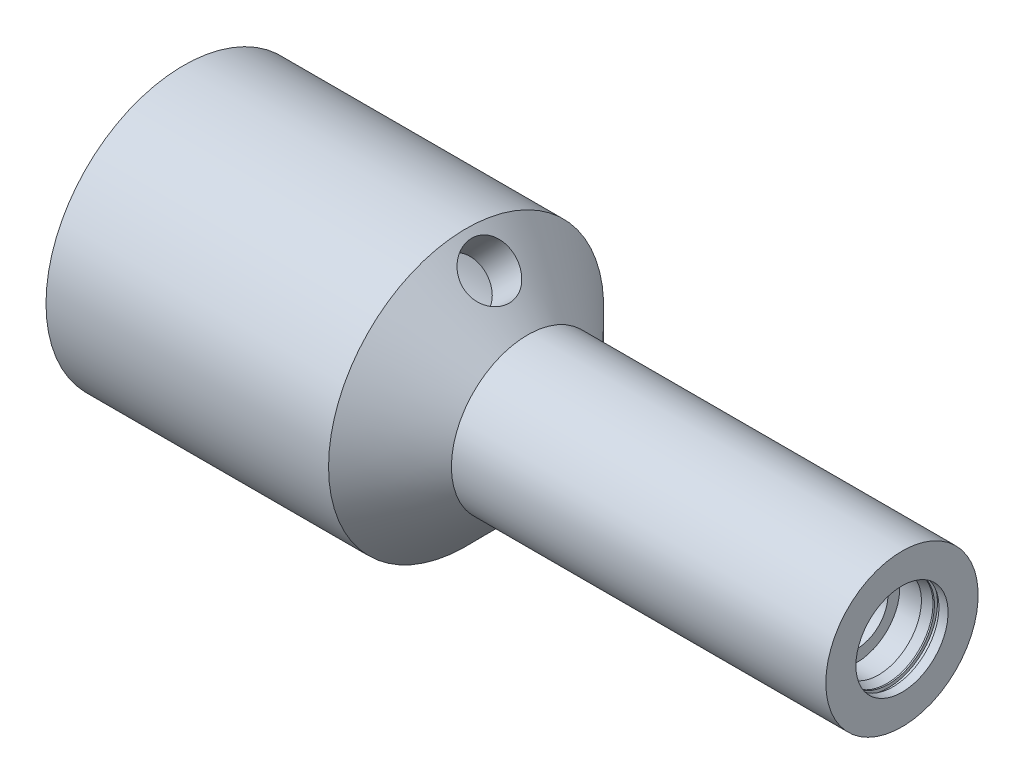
ISO-10303-21;
HEADER;
FILE_DESCRIPTION(('STEP AP214'),'2;1');
FILE_NAME('part.step','',(''),(''),'','','');
FILE_SCHEMA(('AUTOMOTIVE_DESIGN { 1 0 10303 214 1 1 1 1 }'));
ENDSEC;
DATA;
#1=APPLICATION_CONTEXT('core data for automotive mechanical design processes');
#2=APPLICATION_PROTOCOL_DEFINITION('international standard','automotive_design',2000,#1);
#3=PRODUCT_CONTEXT('',#1,'mechanical');
#4=PRODUCT('Part','Part','',(#3));
#5=PRODUCT_RELATED_PRODUCT_CATEGORY('part','',(#4));
#6=PRODUCT_DEFINITION_FORMATION('','',#4);
#7=PRODUCT_DEFINITION_CONTEXT('part definition',#1,'design');
#8=PRODUCT_DEFINITION('design','',#6,#7);
#9=PRODUCT_DEFINITION_SHAPE('','',#8);
#10=(LENGTH_UNIT() NAMED_UNIT(*) SI_UNIT(.MILLI.,.METRE.));
#11=(NAMED_UNIT(*) PLANE_ANGLE_UNIT() SI_UNIT($,.RADIAN.));
#12=(NAMED_UNIT(*) SI_UNIT($,.STERADIAN.) SOLID_ANGLE_UNIT());
#13=UNCERTAINTY_MEASURE_WITH_UNIT(LENGTH_MEASURE(1.E-05),#10,'distance_accuracy_value','');
#14=(GEOMETRIC_REPRESENTATION_CONTEXT(3) GLOBAL_UNCERTAINTY_ASSIGNED_CONTEXT((#13)) GLOBAL_UNIT_ASSIGNED_CONTEXT((#10,
#11,#12)) REPRESENTATION_CONTEXT('',''));
#15=CARTESIAN_POINT('',(0.,0.,0.));
#16=DIRECTION('',(0.,0.,1.));
#17=DIRECTION('',(1.,0.,0.));
#18=AXIS2_PLACEMENT_3D('',#15,#16,#17);
#19=CARTESIAN_POINT('',(64.0540902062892,0.,1.04083408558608E-13));
#20=DIRECTION('',(-1.,0.,0.));
#21=DIRECTION('',(0.,0.,1.));
#22=AXIS2_PLACEMENT_3D('',#19,#20,#21);
#23=CONICAL_SURFACE('',#22,30.1625,0.785398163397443);
#24=CARTESIAN_POINT('',(64.0540902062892,0.,1.04083408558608E-13));
#25=DIRECTION('',(-1.,0.,0.));
#26=DIRECTION('',(0.,0.,1.));
#27=AXIS2_PLACEMENT_3D('',#24,#25,#26);
#28=CIRCLE('',#27,30.1625);
#29=CARTESIAN_POINT('',(64.0540902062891,0.,30.1625000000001));
#30=VERTEX_POINT('',#29);
#31=EDGE_CURVE('E159',#30,#30,#28,.T.);
#32=ORIENTED_EDGE('',*,*,#31,.T.);
#33=EDGE_LOOP('',(#32));
#34=FACE_BOUND('',#33,.T.);
#35=CARTESIAN_POINT('',(77.7065902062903,0.,-1.2490009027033E-13));
#36=DIRECTION('',(-1.,0.,0.));
#37=DIRECTION('',(0.,0.,1.));
#38=AXIS2_PLACEMENT_3D('',#35,#36,#37);
#39=CIRCLE('',#38,16.51);
#40=CARTESIAN_POINT('',(77.7065902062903,0.,16.5099999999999));
#41=VERTEX_POINT('',#40);
#42=EDGE_CURVE('E156',#41,#41,#39,.T.);
#43=ORIENTED_EDGE('',*,*,#42,.F.);
#44=EDGE_LOOP('',(#43));
#45=FACE_BOUND('',#44,.T.);
#46=CARTESIAN_POINT('',(71.1083064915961,22.1790884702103,-6.48696941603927));
#47=CARTESIAN_POINT('',(71.229726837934,22.046299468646,-6.5084440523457));
#48=CARTESIAN_POINT('',(71.3527248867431,21.9138201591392,-6.5224798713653));
#49=CARTESIAN_POINT('',(71.6012549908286,21.6504371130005,-6.53558926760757));
#50=CARTESIAN_POINT('',(71.7267873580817,21.5195335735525,-6.53466099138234));
#51=CARTESIAN_POINT('',(71.9796076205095,21.260345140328,-6.51782200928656));
#52=CARTESIAN_POINT('',(72.1068960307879,21.132061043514,-6.5019068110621));
#53=CARTESIAN_POINT('',(72.362403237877,20.8790846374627,-6.45519486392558));
#54=CARTESIAN_POINT('',(72.4906223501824,20.7543936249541,-6.42439281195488));
#55=CARTESIAN_POINT('',(72.7469658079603,20.5096469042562,-6.34816172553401));
#56=CARTESIAN_POINT('',(72.8750901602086,20.3895881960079,-6.30274234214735));
#57=CARTESIAN_POINT('',(73.1304385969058,20.1547963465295,-6.19759793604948));
#58=CARTESIAN_POINT('',(73.2576623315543,20.0400651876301,-6.13786763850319));
#59=CARTESIAN_POINT('',(73.5101303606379,19.8167431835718,-6.00459341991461));
#60=CARTESIAN_POINT('',(73.6353755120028,19.7081496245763,-5.93105566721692));
#61=CARTESIAN_POINT('',(73.8829918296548,19.4976105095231,-5.77066646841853));
#62=CARTESIAN_POINT('',(74.005361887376,19.3956674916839,-5.68380998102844));
#63=CARTESIAN_POINT('',(74.2465684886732,19.1986287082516,-5.49711821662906));
#64=CARTESIAN_POINT('',(74.3653917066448,19.1035572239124,-5.39724010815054));
#65=CARTESIAN_POINT('',(74.5980874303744,18.9209773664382,-5.18539132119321));
#66=CARTESIAN_POINT('',(74.7119576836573,18.8334724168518,-5.0734152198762));
#67=CARTESIAN_POINT('',(74.9336461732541,18.6663469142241,-4.83817624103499));
#68=CARTESIAN_POINT('',(75.0414647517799,18.5867259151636,-4.71491400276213));
#69=CARTESIAN_POINT('',(75.2500248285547,18.4355363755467,-4.45790859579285));
#70=CARTESIAN_POINT('',(75.3507662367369,18.3639679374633,-4.324165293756));
#71=CARTESIAN_POINT('',(75.5461160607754,18.227608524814,-4.04424040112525));
#72=CARTESIAN_POINT('',(75.6405583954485,18.1629846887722,-3.89786138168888));
#73=CARTESIAN_POINT('',(75.8199182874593,18.0422806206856,-3.5961085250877));
#74=CARTESIAN_POINT('',(75.9048393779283,17.9861972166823,-3.4407380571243));
#75=CARTESIAN_POINT('',(76.0642079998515,17.8825154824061,-3.1219174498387));
#76=CARTESIAN_POINT('',(76.1386515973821,17.8349203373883,-2.95846430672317));
#77=CARTESIAN_POINT('',(76.2760392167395,17.7482202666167,-2.62469767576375));
#78=CARTESIAN_POINT('',(76.3389878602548,17.7091119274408,-2.45438697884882));
#79=CARTESIAN_POINT('',(76.4523830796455,17.6394140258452,-2.10853924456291));
#80=CARTESIAN_POINT('',(76.5028664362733,17.6087993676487,-1.93301933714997));
#81=CARTESIAN_POINT('',(76.590818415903,17.5558926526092,-1.57759052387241));
#82=CARTESIAN_POINT('',(76.6282921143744,17.5335973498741,-1.39768335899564));
#83=CARTESIAN_POINT('',(76.6896723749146,17.4972695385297,-1.0347545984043));
#84=CARTESIAN_POINT('',(76.7135796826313,17.4832365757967,-0.851733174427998));
#85=CARTESIAN_POINT('',(76.7474459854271,17.46340163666,-0.483963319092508));
#86=CARTESIAN_POINT('',(76.7574053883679,17.4575994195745,-0.299214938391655));
#87=CARTESIAN_POINT('',(76.7631172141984,17.4542690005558,0.0643599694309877));
#88=CARTESIAN_POINT('',(76.7593357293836,17.456469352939,0.243176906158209));
#89=CARTESIAN_POINT('',(76.738651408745,17.4685507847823,0.599851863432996));
#90=CARTESIAN_POINT('',(76.7217440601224,17.4784345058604,0.777709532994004));
#91=CARTESIAN_POINT('',(76.6750670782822,17.5059015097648,1.13106113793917));
#92=CARTESIAN_POINT('',(76.6453019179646,17.5234821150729,1.30655587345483));
#93=CARTESIAN_POINT('',(76.5733345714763,17.5663844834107,1.6540801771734));
#94=CARTESIAN_POINT('',(76.531127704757,17.5917091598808,1.82610841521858));
#95=CARTESIAN_POINT('',(76.4351252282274,17.64998963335,2.16458220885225));
#96=CARTESIAN_POINT('',(76.381390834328,17.6829051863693,2.33105208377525));
#97=CARTESIAN_POINT('',(76.262892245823,17.756498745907,2.6583187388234));
#98=CARTESIAN_POINT('',(76.1981240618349,17.7971795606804,2.8191134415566));
#99=CARTESIAN_POINT('',(76.058386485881,17.8863289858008,3.13392446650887));
#100=CARTESIAN_POINT('',(75.9834192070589,17.9347959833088,3.28794218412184));
#101=CARTESIAN_POINT('',(75.8241101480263,18.0395693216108,3.58834724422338));
#102=CARTESIAN_POINT('',(75.7397648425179,18.0958786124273,3.73473168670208));
#103=CARTESIAN_POINT('',(75.559749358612,18.2182820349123,4.02354905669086));
#104=CARTESIAN_POINT('',(75.4638000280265,18.284634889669,4.16569851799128));
#105=CARTESIAN_POINT('',(75.2639007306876,18.4256562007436,4.43998123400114));
#106=CARTESIAN_POINT('',(75.1599477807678,18.5003277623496,4.57211071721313));
#107=CARTESIAN_POINT('',(74.9451614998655,18.6578220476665,4.82538572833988));
#108=CARTESIAN_POINT('',(74.8343303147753,18.7406422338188,4.9465346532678));
#109=CARTESIAN_POINT('',(74.6067836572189,18.9142773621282,5.17711466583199));
#110=CARTESIAN_POINT('',(74.4900660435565,19.0050952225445,5.28654144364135));
#111=CARTESIAN_POINT('',(74.2503592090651,19.1955782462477,5.49415239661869));
#112=CARTESIAN_POINT('',(74.127309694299,19.2953400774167,5.59217837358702));
#113=CARTESIAN_POINT('',(73.8774221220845,19.5022734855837,5.77464342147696));
#114=CARTESIAN_POINT('',(73.7505840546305,19.609445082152,5.85908245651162));
#115=CARTESIAN_POINT('',(73.494228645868,19.8306153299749,6.01371289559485));
#116=CARTESIAN_POINT('',(73.3647115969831,19.9446132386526,6.08390584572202));
#117=CARTESIAN_POINT('',(73.104060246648,20.1787434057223,6.20950044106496));
#118=CARTESIAN_POINT('',(72.9729259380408,20.2988756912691,6.26490202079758));
#119=CARTESIAN_POINT('',(72.7125121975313,20.5421815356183,6.35957872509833));
#120=CARTESIAN_POINT('',(72.583243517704,20.6652572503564,6.39913410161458));
#121=CARTESIAN_POINT('',(72.3250787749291,20.9156467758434,6.46327992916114));
#122=CARTESIAN_POINT('',(72.1961828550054,21.0429620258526,6.48786524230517));
#123=CARTESIAN_POINT('',(71.8115120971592,21.4297462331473,6.53878459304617));
#124=CARTESIAN_POINT('',(71.55746268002,21.6943264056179,6.54238777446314));
#125=CARTESIAN_POINT('',(71.0634010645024,22.2255057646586,6.4889861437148));
#126=CARTESIAN_POINT('',(70.8232810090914,22.4920638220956,6.4325400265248));
#127=CARTESIAN_POINT('',(70.3596163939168,23.0210646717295,6.2617255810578));
#128=CARTESIAN_POINT('',(70.1360729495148,23.2835071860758,6.14735335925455));
#129=CARTESIAN_POINT('',(69.7073197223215,23.7987440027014,5.86218864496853));
#130=CARTESIAN_POINT('',(69.5023718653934,24.0513781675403,5.69071364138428));
#131=CARTESIAN_POINT('',(69.1176857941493,24.5349258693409,5.29647246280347));
#132=CARTESIAN_POINT('',(68.9379496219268,24.7658376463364,5.07370213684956));
#133=CARTESIAN_POINT('',(68.6047587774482,25.2006491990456,4.57981258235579));
#134=CARTESIAN_POINT('',(68.4516624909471,25.4041733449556,4.30812132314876));
#135=CARTESIAN_POINT('',(68.1772361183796,25.7734009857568,3.72552659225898));
#136=CARTESIAN_POINT('',(68.0559055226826,25.9391050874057,3.41462374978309));
#137=CARTESIAN_POINT('',(67.8997477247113,26.1541737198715,2.9265002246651));
#138=CARTESIAN_POINT('',(67.8520514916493,26.2202111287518,2.76041806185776));
#139=CARTESIAN_POINT('',(67.7653293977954,26.340724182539,2.42193261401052));
#140=CARTESIAN_POINT('',(67.7263003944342,26.3952040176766,2.2495316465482));
#141=CARTESIAN_POINT('',(67.6571022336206,26.492067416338,1.89961805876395));
#142=CARTESIAN_POINT('',(67.6269341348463,26.5344495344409,1.72210483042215));
#143=CARTESIAN_POINT('',(67.5756104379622,26.6066932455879,1.36326969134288));
#144=CARTESIAN_POINT('',(67.554454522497,26.6365552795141,1.18194791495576));
#145=CARTESIAN_POINT('',(67.5215044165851,26.6831164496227,0.819475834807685));
#146=CARTESIAN_POINT('',(67.5095790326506,26.7000000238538,0.638361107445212));
#147=CARTESIAN_POINT('',(67.4946465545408,26.7211467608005,0.275033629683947));
#148=CARTESIAN_POINT('',(67.4916392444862,26.7254102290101,0.0928209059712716));
#149=CARTESIAN_POINT('',(67.4945579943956,26.7212745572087,-0.271414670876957));
#150=CARTESIAN_POINT('',(67.5004853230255,26.7128736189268,-0.453437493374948));
#151=CARTESIAN_POINT('',(67.5212417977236,26.6834948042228,-0.815885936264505));
#152=CARTESIAN_POINT('',(67.5360676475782,26.6625215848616,-0.996312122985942));
#153=CARTESIAN_POINT('',(67.5744036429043,26.6084074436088,-1.35303464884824));
#154=CARTESIAN_POINT('',(67.5978497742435,26.5753562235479,-1.52935149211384));
#155=CARTESIAN_POINT('',(67.6533139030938,26.4974007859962,-1.87790069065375));
#156=CARTESIAN_POINT('',(67.6853287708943,26.4525008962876,-2.05013451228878));
#157=CARTESIAN_POINT('',(67.7577942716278,26.3512513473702,-2.38945207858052));
#158=CARTESIAN_POINT('',(67.7982479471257,26.2948975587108,-2.55653394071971));
#159=CARTESIAN_POINT('',(67.88737916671,26.171300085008,-2.88428252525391));
#160=CARTESIAN_POINT('',(67.9360538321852,26.104060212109,-3.04495146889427));
#161=CARTESIAN_POINT('',(68.041836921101,25.958715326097,-3.36011045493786));
#162=CARTESIAN_POINT('',(68.0990096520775,25.8805277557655,-3.51454083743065));
#163=CARTESIAN_POINT('',(68.2212164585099,25.7144474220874,-3.81475261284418));
#164=CARTESIAN_POINT('',(68.2862477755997,25.6265580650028,-3.96053701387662));
#165=CARTESIAN_POINT('',(68.423940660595,25.4417885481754,-4.24262537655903));
#166=CARTESIAN_POINT('',(68.4966065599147,25.3449032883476,-4.37892388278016));
#167=CARTESIAN_POINT('',(68.6491955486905,25.1430768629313,-4.64100037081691));
#168=CARTESIAN_POINT('',(68.7291160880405,25.0381385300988,-4.76678201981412));
#169=CARTESIAN_POINT('',(68.8971579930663,24.819442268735,-5.00886999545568));
#170=CARTESIAN_POINT('',(68.9853852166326,24.7055748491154,-5.12500399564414));
#171=CARTESIAN_POINT('',(69.1685639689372,24.4714962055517,-5.34479902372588));
#172=CARTESIAN_POINT('',(69.2635131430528,24.3512872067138,-5.44846438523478));
#173=CARTESIAN_POINT('',(69.4597053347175,24.1055820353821,-5.64261936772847));
#174=CARTESIAN_POINT('',(69.5609458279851,23.9800879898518,-5.73311422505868));
#175=CARTESIAN_POINT('',(69.7692519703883,23.7249020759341,-5.90032139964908));
#176=CARTESIAN_POINT('',(69.8763167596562,23.595210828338,-5.97703574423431));
#177=CARTESIAN_POINT('',(70.1610591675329,23.254659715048,-6.15750456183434));
#178=CARTESIAN_POINT('',(70.3429075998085,23.041341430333,-6.25025680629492));
#179=CARTESIAN_POINT('',(70.717884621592,22.6114389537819,-6.39754166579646));
#180=CARTESIAN_POINT('',(70.9110127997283,22.3948548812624,-6.45207567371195));
#181=CARTESIAN_POINT('',(71.1083064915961,22.1790884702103,-6.48696941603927));
#182=B_SPLINE_CURVE_WITH_KNOTS('',3,(#46,#47,#48,#49,#50,#51,#52,#53,#54,#55,#56,#57,#58,#59,
#60,#61,#62,#63,#64,#65,#66,#67,#68,#69,#70,#71,#72,#73,#74,#75,#76,#77,#78,#79,#80,#81,#82,#83,
#84,#85,#86,#87,#88,#89,#90,#91,#92,#93,#94,#95,#96,#97,#98,#99,#100,#101,#102,#103,#104,#105,
#106,#107,#108,#109,#110,#111,#112,#113,#114,#115,#116,#117,#118,#119,#120,#121,#122,#123,#124,
#125,#126,#127,#128,#129,#130,#131,#132,#133,#134,#135,#136,#137,#138,#139,#140,#141,#142,#143,
#144,#145,#146,#147,#148,#149,#150,#151,#152,#153,#154,#155,#156,#157,#158,#159,#160,#161,#162,
#163,#164,#165,#166,#167,#168,#169,#170,#171,#172,#173,#174,#175,#176,#177,#178,#179,#180,#181),
.UNSPECIFIED.,.T.,.F.,(4,2,2,2,2,2,2,2,2,2,2,2,2,2,2,2,2,2,2,2,2,2,2,2,2,2,2,2,2,2,2,2,2,2,2,2,
2,2,2,2,2,2,2,2,2,2,2,2,2,2,2,2,2,2,2,2,2,2,2,2,2,2,2,2,2,2,2,4),(0.,0.543380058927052,
1.08682742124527,1.630437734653,2.17424183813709,2.71768763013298,3.26133403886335,
3.8047381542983,4.34834846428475,4.89379422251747,5.4394854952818,5.98514587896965,
6.53081320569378,7.0875611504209,7.64410180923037,8.20085087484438,8.75737559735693,
9.31223803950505,9.86688376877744,10.4214990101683,10.9760980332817,11.5120632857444,
12.0482128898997,12.5841761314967,13.1203412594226,13.6537266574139,14.1873053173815,
14.7207735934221,15.2544430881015,15.8054736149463,16.356710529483,16.9077763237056,
17.4590440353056,18.0172249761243,18.5754073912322,19.1335291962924,19.6916534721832,
20.2394177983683,20.7873700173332,21.8820513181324,22.9666361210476,24.0512938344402,
25.1494111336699,26.2476173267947,27.3596147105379,28.4715942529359,29.0259949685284,
29.5801943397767,30.1344598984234,30.6887059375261,31.2349219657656,31.7811247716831,
32.3274051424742,32.8734832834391,33.4155855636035,33.9574901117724,34.4995903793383,
35.0415012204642,35.5877439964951,36.1337955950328,36.6801586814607,37.2263304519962,
37.7807728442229,38.3350219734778,38.8890501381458,39.4429967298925,40.3259571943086,
41.2088854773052),.UNSPECIFIED.);
#183=CARTESIAN_POINT('',(71.1083064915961,22.1790884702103,-6.48696941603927));
#184=VERTEX_POINT('',#183);
#185=EDGE_CURVE('E81',#184,#184,#182,.T.);
#186=ORIENTED_EDGE('',*,*,#185,.F.);
#187=EDGE_LOOP('',(#186));
#188=FACE_BOUND('',#187,.T.);
#189=ADVANCED_FACE('F32',(#34,#45,#188),#23,.F.);
#190=CARTESIAN_POINT('',(88.9000000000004,0.,-1.31838984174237E-13));
#191=DIRECTION('',(-1.,0.,0.));
#192=DIRECTION('',(0.,0.,1.));
#193=AXIS2_PLACEMENT_3D('',#190,#191,#192);
#194=CONICAL_SURFACE('',#193,19.685,0.785398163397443);
#195=CARTESIAN_POINT('',(73.025,0.,-1.17961196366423E-13));
#196=DIRECTION('',(-1.,0.,0.));
#197=DIRECTION('',(0.,0.,1.));
#198=AXIS2_PLACEMENT_3D('',#195,#196,#197);
#199=CIRCLE('',#198,35.56);
#200=CARTESIAN_POINT('',(73.0249999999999,0.,35.5599999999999));
#201=VERTEX_POINT('',#200);
#202=EDGE_CURVE('E114',#201,#201,#199,.T.);
#203=ORIENTED_EDGE('',*,*,#202,.F.);
#204=EDGE_LOOP('',(#203));
#205=FACE_BOUND('',#204,.T.);
#206=CARTESIAN_POINT('',(88.9000000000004,0.,-1.31838984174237E-13));
#207=DIRECTION('',(-1.,0.,0.));
#208=DIRECTION('',(0.,0.,1.));
#209=AXIS2_PLACEMENT_3D('',#206,#207,#208);
#210=CIRCLE('',#209,19.685);
#211=CARTESIAN_POINT('',(88.9000000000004,0.,19.6849999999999));
#212=VERTEX_POINT('',#211);
#213=EDGE_CURVE('E117',#212,#212,#210,.T.);
#214=ORIENTED_EDGE('',*,*,#213,.T.);
#215=EDGE_LOOP('',(#214));
#216=FACE_BOUND('',#215,.T.);
#217=CARTESIAN_POINT('',(82.6678779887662,25.4992847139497,-4.63504502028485));
#218=CARTESIAN_POINT('',(82.563693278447,25.5795238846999,-4.77617189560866));
#219=CARTESIAN_POINT('',(82.4554008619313,25.6640297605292,-4.91178814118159));
#220=CARTESIAN_POINT('',(82.2315616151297,25.841339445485,-5.17117623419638));
#221=CARTESIAN_POINT('',(82.1160133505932,25.9341448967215,-5.29494572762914));
#222=CARTESIAN_POINT('',(81.8786790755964,26.1277234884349,-5.52980349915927));
#223=CARTESIAN_POINT('',(81.7568892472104,26.2285015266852,-5.64088387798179));
#224=CARTESIAN_POINT('',(81.5081638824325,26.4375567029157,-5.84952985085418));
#225=CARTESIAN_POINT('',(81.3812265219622,26.5458365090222,-5.94709059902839));
#226=CARTESIAN_POINT('',(81.1233364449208,26.7692995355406,-6.12793629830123));
#227=CARTESIAN_POINT('',(80.9923839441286,26.8844823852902,-6.21122201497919));
#228=CARTESIAN_POINT('',(80.7275343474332,27.1210988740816,-6.36290834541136));
#229=CARTESIAN_POINT('',(80.5936372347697,27.2425325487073,-6.4313088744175));
#230=CARTESIAN_POINT('',(80.3239991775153,27.4908583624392,-6.5526939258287));
#231=CARTESIAN_POINT('',(80.1882587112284,27.6177491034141,-6.60568237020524));
#232=CARTESIAN_POINT('',(79.9159396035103,27.8761655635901,-6.69586479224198));
#233=CARTESIAN_POINT('',(79.7793609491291,28.0076913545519,-6.73305852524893));
#234=CARTESIAN_POINT('',(79.5076031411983,28.2732364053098,-6.79110565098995));
#235=CARTESIAN_POINT('',(79.3724224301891,28.4072226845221,-6.81210272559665));
#236=CARTESIAN_POINT('',(79.1031251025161,28.6778820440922,-6.83815619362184));
#237=CARTESIAN_POINT('',(78.9690088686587,28.8145560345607,-6.84320709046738));
#238=CARTESIAN_POINT('',(78.7028266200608,29.0894570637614,-6.83732094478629));
#239=CARTESIAN_POINT('',(78.5707599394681,29.2276835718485,-6.82638920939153));
#240=CARTESIAN_POINT('',(78.3094226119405,29.5047043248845,-6.78862823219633));
#241=CARTESIAN_POINT('',(78.1801530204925,29.6434987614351,-6.76179309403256));
#242=CARTESIAN_POINT('',(77.9255726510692,29.9201413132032,-6.69251403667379));
#243=CARTESIAN_POINT('',(77.8002525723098,30.0579909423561,-6.65011031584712));
#244=CARTESIAN_POINT('',(77.5539023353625,30.3320440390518,-6.54997981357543));
#245=CARTESIAN_POINT('',(77.4328737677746,30.4682468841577,-6.49224741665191));
#246=CARTESIAN_POINT('',(77.1958611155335,30.7378036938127,-6.36190425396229));
#247=CARTESIAN_POINT('',(77.0798753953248,30.8711585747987,-6.28929835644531));
#248=CARTESIAN_POINT('',(76.8534780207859,31.1340222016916,-6.12968018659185));
#249=CARTESIAN_POINT('',(76.7430684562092,31.2635294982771,-6.04266256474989));
#250=CARTESIAN_POINT('',(76.5274948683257,31.5186886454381,-5.8540215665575));
#251=CARTESIAN_POINT('',(76.4223850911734,31.6442969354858,-5.75227724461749));
#252=CARTESIAN_POINT('',(76.2189532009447,31.8894400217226,-5.5354351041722));
#253=CARTESIAN_POINT('',(76.1206336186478,32.0089725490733,-5.42033234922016));
#254=CARTESIAN_POINT('',(75.9313370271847,32.240860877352,-5.17762272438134));
#255=CARTESIAN_POINT('',(75.8403575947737,32.3532190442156,-5.05002001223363));
#256=CARTESIAN_POINT('',(75.6661399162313,32.5698434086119,-4.7831646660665));
#257=CARTESIAN_POINT('',(75.5829045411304,32.6741066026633,-4.64390774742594));
#258=CARTESIAN_POINT('',(75.3446669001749,32.9743323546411,-4.20857583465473));
#259=CARTESIAN_POINT('',(75.2019570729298,33.1567145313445,-3.8960008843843));
#260=CARTESIAN_POINT('',(74.9525067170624,33.4781947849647,-3.23638679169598));
#261=CARTESIAN_POINT('',(74.8457649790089,33.6172943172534,-2.88934880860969));
#262=CARTESIAN_POINT('',(74.670814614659,33.8464848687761,-2.17264655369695));
#263=CARTESIAN_POINT('',(74.6023773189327,33.9368666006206,-1.80313147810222));
#264=CARTESIAN_POINT('',(74.5044903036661,34.0664293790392,-1.05023932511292));
#265=CARTESIAN_POINT('',(74.4750380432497,34.105613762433,-0.666863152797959));
#266=CARTESIAN_POINT('',(74.4558171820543,34.1311670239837,0.098847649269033));
#267=CARTESIAN_POINT('',(74.4656612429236,34.1180514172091,0.481155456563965));
#268=CARTESIAN_POINT('',(74.523958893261,34.04066226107,1.23754989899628));
#269=CARTESIAN_POINT('',(74.5724118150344,33.9763895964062,1.61163667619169));
#270=CARTESIAN_POINT('',(74.7068133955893,33.7992640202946,2.34033480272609));
#271=CARTESIAN_POINT('',(74.7926932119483,33.6865003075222,2.69498056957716));
#272=CARTESIAN_POINT('',(75.0002333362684,33.4165284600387,3.37573250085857));
#273=CARTESIAN_POINT('',(75.1218953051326,33.2593182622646,3.70183733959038));
#274=CARTESIAN_POINT('',(75.3997997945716,32.9045670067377,4.31918757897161));
#275=CARTESIAN_POINT('',(75.556319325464,32.7067039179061,4.6101231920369));
#276=CARTESIAN_POINT('',(75.9003361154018,32.2783746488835,5.14606545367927));
#277=CARTESIAN_POINT('',(76.0878352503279,32.0479064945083,5.39106931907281));
#278=CARTESIAN_POINT('',(76.4919255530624,31.5600980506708,5.83037284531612));
#279=CARTESIAN_POINT('',(76.708755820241,31.3025412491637,6.02421242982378));
#280=CARTESIAN_POINT('',(77.1657705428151,30.7710011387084,6.35287601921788));
#281=CARTESIAN_POINT('',(77.4059548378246,30.497017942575,6.48770042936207));
#282=CARTESIAN_POINT('',(77.9039932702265,29.9422286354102,6.69423769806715));
#283=CARTESIAN_POINT('',(78.161819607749,29.6614336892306,6.7660474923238));
#284=CARTESIAN_POINT('',(78.6892620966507,29.1018160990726,6.84469748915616));
#285=CARTESIAN_POINT('',(78.9588773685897,28.8229933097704,6.85154252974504));
#286=CARTESIAN_POINT('',(79.5000944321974,28.2787756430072,6.80030034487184));
#287=CARTESIAN_POINT('',(79.7716522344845,28.0132774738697,6.74283648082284));
#288=CARTESIAN_POINT('',(80.3117548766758,27.5003743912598,6.56556478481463));
#289=CARTESIAN_POINT('',(80.5802997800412,27.2529690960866,6.44575826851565));
#290=CARTESIAN_POINT('',(80.9739830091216,26.9007715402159,6.22242848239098));
#291=CARTESIAN_POINT('',(81.1035915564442,26.7866051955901,6.14079527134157));
#292=CARTESIAN_POINT('',(81.3589245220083,26.5649949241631,5.96356599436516));
#293=CARTESIAN_POINT('',(81.4846503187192,26.4575485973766,5.86797495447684));
#294=CARTESIAN_POINT('',(81.7312298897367,26.2498810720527,5.66345601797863));
#295=CARTESIAN_POINT('',(81.8520815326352,26.1496630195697,5.55452236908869));
#296=CARTESIAN_POINT('',(82.0877853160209,25.9569744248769,5.32414526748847));
#297=CARTESIAN_POINT('',(82.2026395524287,25.8645011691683,5.20270622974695));
#298=CARTESIAN_POINT('',(82.4265856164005,25.6866597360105,4.94671889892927));
#299=CARTESIAN_POINT('',(82.5356006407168,25.6013803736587,4.81204170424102));
#300=CARTESIAN_POINT('',(82.7454214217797,25.4393953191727,4.53168603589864));
#301=CARTESIAN_POINT('',(82.8462301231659,25.3626865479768,4.38601154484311));
#302=CARTESIAN_POINT('',(83.0387220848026,25.2180004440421,4.08453923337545));
#303=CARTESIAN_POINT('',(83.1304014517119,25.1500268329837,3.9287371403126));
#304=CARTESIAN_POINT('',(83.3035974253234,25.0230408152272,3.60817819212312));
#305=CARTESIAN_POINT('',(83.3851178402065,24.9640250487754,3.44342472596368));
#306=CARTESIAN_POINT('',(83.5375663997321,24.8547434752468,3.10508995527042));
#307=CARTESIAN_POINT('',(83.6084331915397,24.8045280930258,2.9314646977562));
#308=CARTESIAN_POINT('',(83.7381810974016,24.7133571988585,2.57750979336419));
#309=CARTESIAN_POINT('',(83.7970665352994,24.6723983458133,2.39718259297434));
#310=CARTESIAN_POINT('',(83.9021692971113,24.5997783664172,2.03103481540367));
#311=CARTESIAN_POINT('',(83.9483859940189,24.5681177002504,1.84521396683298));
#312=CARTESIAN_POINT('',(84.0275588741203,24.5141410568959,1.46944070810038));
#313=CARTESIAN_POINT('',(84.060515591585,24.4918247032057,1.2794884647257));
#314=CARTESIAN_POINT('',(84.1123184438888,24.4568465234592,0.899930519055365));
#315=CARTESIAN_POINT('',(84.1313830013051,24.4440351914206,0.710368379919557));
#316=CARTESIAN_POINT('',(84.1560110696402,24.4274988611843,0.329978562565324));
#317=CARTESIAN_POINT('',(84.1615749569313,24.4237736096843,0.139150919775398));
#318=CARTESIAN_POINT('',(84.1591290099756,24.4254132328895,-0.242435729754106));
#319=CARTESIAN_POINT('',(84.1511150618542,24.4307808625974,-0.433194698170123));
#320=CARTESIAN_POINT('',(84.1216163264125,24.4506018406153,-0.813120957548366));
#321=CARTESIAN_POINT('',(84.1001365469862,24.4650518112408,-1.00228881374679));
#322=CARTESIAN_POINT('',(84.0443467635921,24.5027759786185,-1.37534313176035));
#323=CARTESIAN_POINT('',(84.01020348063,24.5259355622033,-1.5592661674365));
#324=CARTESIAN_POINT('',(83.9294989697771,24.581053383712,-1.92295058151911));
#325=CARTESIAN_POINT('',(83.882942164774,24.6130084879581,-2.10271341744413));
#326=CARTESIAN_POINT('',(83.7779839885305,24.6856623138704,-2.4568315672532));
#327=CARTESIAN_POINT('',(83.7195888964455,24.7263564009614,-2.63118969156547));
#328=CARTESIAN_POINT('',(83.591629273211,24.8164217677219,-2.97338495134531));
#329=CARTESIAN_POINT('',(83.5220666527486,24.865791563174,-3.14122319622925));
#330=CARTESIAN_POINT('',(83.3379262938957,24.9979614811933,-3.54518667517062));
#331=CARTESIAN_POINT('',(83.217397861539,25.0856696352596,-3.77704289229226));
#332=CARTESIAN_POINT('',(82.9566568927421,25.2791210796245,-4.22134993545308));
#333=CARTESIAN_POINT('',(82.8164438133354,25.384864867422,-4.43380022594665));
#334=CARTESIAN_POINT('',(82.6678779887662,25.4992847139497,-4.63504502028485));
#335=B_SPLINE_CURVE_WITH_KNOTS('',3,(#217,#218,#219,#220,#221,#222,#223,#224,#225,#226,#227,
#228,#229,#230,#231,#232,#233,#234,#235,#236,#237,#238,#239,#240,#241,#242,#243,#244,#245,#246,
#247,#248,#249,#250,#251,#252,#253,#254,#255,#256,#257,#258,#259,#260,#261,#262,#263,#264,#265,
#266,#267,#268,#269,#270,#271,#272,#273,#274,#275,#276,#277,#278,#279,#280,#281,#282,#283,#284,
#285,#286,#287,#288,#289,#290,#291,#292,#293,#294,#295,#296,#297,#298,#299,#300,#301,#302,#303,
#304,#305,#306,#307,#308,#309,#310,#311,#312,#313,#314,#315,#316,#317,#318,#319,#320,#321,#322,
#323,#324,#325,#326,#327,#328,#329,#330,#331,#332,#333,#334),.UNSPECIFIED.,.T.,.F.,(4,2,2,2,2,2,
2,2,2,2,2,2,2,2,2,2,2,2,2,2,2,2,2,2,2,2,2,2,2,2,2,2,2,2,2,2,2,2,2,2,2,2,2,2,2,2,2,2,2,2,2,2,2,2,
2,2,2,2,4),(0.,0.578458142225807,1.15703098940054,1.73596207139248,2.31510012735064,
2.8942071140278,3.47331739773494,4.05228018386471,4.63125193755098,5.20502655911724,
5.77899893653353,6.35278076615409,6.92677546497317,7.49929840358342,8.07203136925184,
8.64457717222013,9.21733597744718,9.79509799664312,10.3730742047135,10.9508588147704,
11.5288567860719,12.6898436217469,13.8507914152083,15.0047325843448,16.1585985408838,
17.3011192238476,18.4436201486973,19.5840283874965,20.7244895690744,21.8743596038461,
23.0242992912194,24.1842519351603,25.3441966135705,26.5023537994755,27.6604247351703,
28.8073667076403,29.9542844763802,30.5268572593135,31.099224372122,31.6718391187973,
32.2442523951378,32.8229290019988,33.4013970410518,33.9801107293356,34.558606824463,
35.140316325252,35.7218155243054,36.3033434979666,36.8848480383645,37.4569999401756,
38.0291358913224,38.6014452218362,39.1735418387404,39.7383594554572,40.30297609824,
40.8672940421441,41.4315155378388,42.2563653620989,43.0812379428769),.UNSPECIFIED.);
#336=CARTESIAN_POINT('',(82.6678779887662,25.4992847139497,-4.63504502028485));
#337=VERTEX_POINT('',#336);
#338=EDGE_CURVE('E11',#337,#337,#335,.T.);
#339=ORIENTED_EDGE('',*,*,#338,.F.);
#340=EDGE_LOOP('',(#339));
#341=FACE_BOUND('',#340,.T.);
#342=ADVANCED_FACE('F184',(#205,#216,#341),#194,.T.);
#343=CARTESIAN_POINT('',(0.,35.56,0.));
#344=DIRECTION('',(1.,0.,0.));
#345=DIRECTION('',(0.,0.,-1.));
#346=AXIS2_PLACEMENT_3D('',#343,#344,#345);
#347=PLANE('',#346);
#348=CARTESIAN_POINT('',(0.,0.,0.));
#349=DIRECTION('',(1.,0.,0.));
#350=DIRECTION('',(0.,0.,-1.));
#351=AXIS2_PLACEMENT_3D('',#348,#349,#350);
#352=CIRCLE('',#351,30.8957348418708);
#353=CARTESIAN_POINT('',(0.,0.,-30.8957348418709));
#354=VERTEX_POINT('',#353);
#355=EDGE_CURVE('E45',#354,#354,#352,.T.);
#356=ORIENTED_EDGE('',*,*,#355,.T.);
#357=EDGE_LOOP('',(#356));
#358=FACE_BOUND('',#357,.T.);
#359=CARTESIAN_POINT('',(1.11022302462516E-13,-28.5961588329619,-16.5100000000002));
#360=DIRECTION('',(-1.,0.,0.));
#361=DIRECTION('',(0.,0.,1.));
#362=AXIS2_PLACEMENT_3D('',#359,#360,#361);
#363=CIRCLE('',#362,1.524);
#364=CARTESIAN_POINT('',(1.08188236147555E-13,-28.5961588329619,-14.9860000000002));
#365=VERTEX_POINT('',#364);
#366=EDGE_CURVE('E75',#365,#365,#363,.T.);
#367=ORIENTED_EDGE('',*,*,#366,.F.);
#368=EDGE_LOOP('',(#367));
#369=FACE_BOUND('',#368,.T.);
#370=CARTESIAN_POINT('',(2.22044604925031E-13,-28.5961588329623,16.5099999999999));
#371=DIRECTION('',(-1.,0.,0.));
#372=DIRECTION('',(0.,0.,1.));
#373=AXIS2_PLACEMENT_3D('',#370,#371,#372);
#374=CIRCLE('',#373,1.524);
#375=CARTESIAN_POINT('',(2.19210538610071E-13,-28.5961588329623,18.0339999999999));
#376=VERTEX_POINT('',#375);
#377=EDGE_CURVE('E74',#376,#376,#374,.T.);
#378=ORIENTED_EDGE('',*,*,#377,.F.);
#379=EDGE_LOOP('',(#378));
#380=FACE_BOUND('',#379,.T.);
#381=CARTESIAN_POINT('',(-4.44089209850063E-13,-1.90819582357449E-13,33.0200000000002));
#382=DIRECTION('',(-1.,0.,0.));
#383=DIRECTION('',(0.,0.,1.));
#384=AXIS2_PLACEMENT_3D('',#381,#382,#383);
#385=CIRCLE('',#384,1.524);
#386=CARTESIAN_POINT('',(-4.46923276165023E-13,-1.90863202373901E-13,34.5440000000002));
#387=VERTEX_POINT('',#386);
#388=EDGE_CURVE('E87',#387,#387,#385,.T.);
#389=ORIENTED_EDGE('',*,*,#388,.F.);
#390=EDGE_LOOP('',(#389));
#391=FACE_BOUND('',#390,.T.);
#392=CARTESIAN_POINT('',(1.11022302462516E-13,28.5961588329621,16.5100000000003));
#393=DIRECTION('',(-1.,0.,0.));
#394=DIRECTION('',(0.,0.,1.));
#395=AXIS2_PLACEMENT_3D('',#392,#393,#394);
#396=CIRCLE('',#395,1.524);
#397=CARTESIAN_POINT('',(1.08188236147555E-13,28.5961588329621,18.0340000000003));
#398=VERTEX_POINT('',#397);
#399=EDGE_CURVE('E93',#398,#398,#396,.T.);
#400=ORIENTED_EDGE('',*,*,#399,.F.);
#401=EDGE_LOOP('',(#400));
#402=FACE_BOUND('',#401,.T.);
#403=CARTESIAN_POINT('',(-2.22044604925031E-13,28.5961588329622,-16.5099999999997));
#404=DIRECTION('',(-1.,0.,0.));
#405=DIRECTION('',(0.,0.,1.));
#406=AXIS2_PLACEMENT_3D('',#403,#404,#405);
#407=CIRCLE('',#406,1.524);
#408=CARTESIAN_POINT('',(-2.24878671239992E-13,28.5961588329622,-14.9859999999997));
#409=VERTEX_POINT('',#408);
#410=EDGE_CURVE('E99',#409,#409,#407,.T.);
#411=ORIENTED_EDGE('',*,*,#410,.F.);
#412=EDGE_LOOP('',(#411));
#413=FACE_BOUND('',#412,.T.);
#414=CARTESIAN_POINT('',(4.44089209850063E-13,0.,-33.0199999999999));
#415=DIRECTION('',(-1.,0.,0.));
#416=DIRECTION('',(0.,0.,1.));
#417=AXIS2_PLACEMENT_3D('',#414,#415,#416);
#418=CIRCLE('',#417,1.524);
#419=CARTESIAN_POINT('',(4.41255143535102E-13,0.,-31.4959999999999));
#420=VERTEX_POINT('',#419);
#421=EDGE_CURVE('E105',#420,#420,#418,.T.);
#422=ORIENTED_EDGE('',*,*,#421,.F.);
#423=EDGE_LOOP('',(#422));
#424=FACE_BOUND('',#423,.T.);
#425=CARTESIAN_POINT('',(0.,0.,0.));
#426=DIRECTION('',(-1.,0.,0.));
#427=DIRECTION('',(0.,0.,1.));
#428=AXIS2_PLACEMENT_3D('',#425,#426,#427);
#429=CIRCLE('',#428,35.56);
#430=CARTESIAN_POINT('',(0.,0.,35.56));
#431=VERTEX_POINT('',#430);
#432=EDGE_CURVE('E111',#431,#431,#429,.T.);
#433=ORIENTED_EDGE('',*,*,#432,.T.);
#434=EDGE_LOOP('',(#433));
#435=FACE_BOUND('',#434,.T.);
#436=ADVANCED_FACE('F34',(#358,#369,#380,#391,#402,#413,#424,#435),#347,.F.);
#437=CARTESIAN_POINT('',(0.,0.,0.));
#438=DIRECTION('',(-1.,0.,0.));
#439=DIRECTION('',(0.,0.,1.));
#440=AXIS2_PLACEMENT_3D('',#437,#438,#439);
#441=CYLINDRICAL_SURFACE('',#440,30.1625);
#442=CARTESIAN_POINT('',(1.26999999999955,0.,0.));
#443=DIRECTION('',(1.,0.,0.));
#444=DIRECTION('',(0.,0.,-1.));
#445=AXIS2_PLACEMENT_3D('',#442,#443,#444);
#446=CIRCLE('',#445,30.1625);
#447=CARTESIAN_POINT('',(1.26999999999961,0.,-30.1625));
#448=VERTEX_POINT('',#447);
#449=EDGE_CURVE('E162',#448,#448,#446,.F.);
#450=ORIENTED_EDGE('',*,*,#449,.T.);
#451=EDGE_LOOP('',(#450));
#452=FACE_BOUND('',#451,.T.);
#453=ORIENTED_EDGE('',*,*,#31,.F.);
#454=EDGE_LOOP('',(#453));
#455=FACE_BOUND('',#454,.T.);
#456=ADVANCED_FACE('F176',(#452,#455),#441,.F.);
#457=CARTESIAN_POINT('',(0.,0.,0.));
#458=DIRECTION('',(-1.,0.,0.));
#459=DIRECTION('',(0.,0.,1.));
#460=AXIS2_PLACEMENT_3D('',#457,#458,#459);
#461=CYLINDRICAL_SURFACE('',#460,16.51);
#462=CARTESIAN_POINT('',(171.45,1.14491749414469E-13,-2.42861286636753E-13));
#463=DIRECTION('',(-1.,0.,0.));
#464=DIRECTION('',(0.,0.,1.));
#465=AXIS2_PLACEMENT_3D('',#462,#463,#464);
#466=CIRCLE('',#465,16.51);
#467=CARTESIAN_POINT('',(171.45,1.1401919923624E-13,16.5099999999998));
#468=VERTEX_POINT('',#467);
#469=EDGE_CURVE('E153',#468,#468,#466,.T.);
#470=ORIENTED_EDGE('',*,*,#469,.F.);
#471=EDGE_LOOP('',(#470));
#472=FACE_BOUND('',#471,.T.);
#473=ORIENTED_EDGE('',*,*,#42,.T.);
#474=EDGE_LOOP('',(#473));
#475=FACE_BOUND('',#474,.T.);
#476=ADVANCED_FACE('F179',(#472,#475),#461,.F.);
#477=CARTESIAN_POINT('',(171.45,16.5100000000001,-1.31838984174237E-13));
#478=DIRECTION('',(1.,0.,0.));
#479=DIRECTION('',(0.,0.,-1.));
#480=AXIS2_PLACEMENT_3D('',#477,#478,#479);
#481=PLANE('',#480);
#482=CARTESIAN_POINT('',(171.45,1.14491749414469E-13,-2.42861286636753E-13));
#483=DIRECTION('',(-1.,0.,0.));
#484=DIRECTION('',(0.,0.,1.));
#485=AXIS2_PLACEMENT_3D('',#482,#483,#484);
#486=CIRCLE('',#485,8.0645);
#487=CARTESIAN_POINT('',(171.45,1.14260926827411E-13,8.06449999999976));
#488=VERTEX_POINT('',#487);
#489=EDGE_CURVE('E150',#488,#488,#486,.T.);
#490=ORIENTED_EDGE('',*,*,#489,.F.);
#491=EDGE_LOOP('',(#490));
#492=FACE_BOUND('',#491,.T.);
#493=ORIENTED_EDGE('',*,*,#469,.T.);
#494=EDGE_LOOP('',(#493));
#495=FACE_BOUND('',#494,.T.);
#496=ADVANCED_FACE('F290',(#492,#495),#481,.F.);
#497=CARTESIAN_POINT('',(0.,0.,0.));
#498=DIRECTION('',(-1.,0.,0.));
#499=DIRECTION('',(0.,0.,1.));
#500=AXIS2_PLACEMENT_3D('',#497,#498,#499);
#501=CYLINDRICAL_SURFACE('',#500,8.0645);
#502=CARTESIAN_POINT('',(173.99,1.42247325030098E-13,-2.35922392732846E-13));
#503=DIRECTION('',(-1.,0.,0.));
#504=DIRECTION('',(0.,0.,1.));
#505=AXIS2_PLACEMENT_3D('',#502,#503,#504);
#506=CIRCLE('',#505,8.0645);
#507=CARTESIAN_POINT('',(173.99,1.4201650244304E-13,8.06449999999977));
#508=VERTEX_POINT('',#507);
#509=EDGE_CURVE('E147',#508,#508,#506,.T.);
#510=ORIENTED_EDGE('',*,*,#509,.F.);
#511=EDGE_LOOP('',(#510));
#512=FACE_BOUND('',#511,.T.);
#513=ORIENTED_EDGE('',*,*,#489,.T.);
#514=EDGE_LOOP('',(#513));
#515=FACE_BOUND('',#514,.T.);
#516=ADVANCED_FACE('F286',(#512,#515),#501,.F.);
#517=CARTESIAN_POINT('',(173.99,8.06450000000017,-2.98372437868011E-13));
#518=DIRECTION('',(-1.,0.,0.));
#519=DIRECTION('',(0.,0.,1.));
#520=AXIS2_PLACEMENT_3D('',#517,#518,#519);
#521=PLANE('',#520);
#522=CARTESIAN_POINT('',(173.99,1.42247325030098E-13,-2.35922392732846E-13));
#523=DIRECTION('',(-1.,0.,0.));
#524=DIRECTION('',(0.,0.,1.));
#525=AXIS2_PLACEMENT_3D('',#522,#523,#524);
#526=CIRCLE('',#525,11.1125);
#527=CARTESIAN_POINT('',(173.99,1.41929262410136E-13,11.1124999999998));
#528=VERTEX_POINT('',#527);
#529=EDGE_CURVE('E144',#528,#528,#526,.T.);
#530=ORIENTED_EDGE('',*,*,#529,.F.);
#531=EDGE_LOOP('',(#530));
#532=FACE_BOUND('',#531,.T.);
#533=ORIENTED_EDGE('',*,*,#509,.T.);
#534=EDGE_LOOP('',(#533));
#535=FACE_BOUND('',#534,.T.);
#536=ADVANCED_FACE('F282',(#532,#535),#521,.F.);
#537=CARTESIAN_POINT('',(0.,0.,0.));
#538=DIRECTION('',(-1.,0.,0.));
#539=DIRECTION('',(0.,0.,1.));
#540=AXIS2_PLACEMENT_3D('',#537,#538,#539);
#541=CYLINDRICAL_SURFACE('',#540,11.1125);
#542=CARTESIAN_POINT('',(179.578000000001,1.14491749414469E-13,-1.80411241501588E-13));
#543=DIRECTION('',(-1.,0.,0.));
#544=DIRECTION('',(0.,0.,1.));
#545=AXIS2_PLACEMENT_3D('',#542,#543,#544);
#546=CIRCLE('',#545,11.1125);
#547=CARTESIAN_POINT('',(179.578000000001,1.14173686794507E-13,11.1124999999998));
#548=VERTEX_POINT('',#547);
#549=EDGE_CURVE('E141',#548,#548,#546,.T.);
#550=ORIENTED_EDGE('',*,*,#549,.F.);
#551=EDGE_LOOP('',(#550));
#552=FACE_BOUND('',#551,.T.);
#553=ORIENTED_EDGE('',*,*,#529,.T.);
#554=EDGE_LOOP('',(#553));
#555=FACE_BOUND('',#554,.T.);
#556=ADVANCED_FACE('F278',(#552,#555),#541,.F.);
#557=CARTESIAN_POINT('',(179.578000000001,1.14491749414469E-13,-1.80411241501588E-13));
#558=DIRECTION('',(1.,0.,0.));
#559=DIRECTION('',(0.,0.,-1.));
#560=AXIS2_PLACEMENT_3D('',#557,#558,#559);
#561=CONICAL_SURFACE('',#560,11.1125,0.349065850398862);
#562=CARTESIAN_POINT('',(181.776256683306,1.28369537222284E-13,-1.17961196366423E-13));
#563=DIRECTION('',(-1.,0.,0.));
#564=DIRECTION('',(0.,0.,1.));
#565=AXIS2_PLACEMENT_3D('',#562,#563,#564);
#566=CIRCLE('',#565,11.9126);
#567=CARTESIAN_POINT('',(181.776256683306,1.28028574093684E-13,11.9125999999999));
#568=VERTEX_POINT('',#567);
#569=EDGE_CURVE('E138',#568,#568,#566,.T.);
#570=ORIENTED_EDGE('',*,*,#569,.F.);
#571=EDGE_LOOP('',(#570));
#572=FACE_BOUND('',#571,.T.);
#573=ORIENTED_EDGE('',*,*,#549,.T.);
#574=EDGE_LOOP('',(#573));
#575=FACE_BOUND('',#574,.T.);
#576=ADVANCED_FACE('F274',(#572,#575),#561,.F.);
#577=CARTESIAN_POINT('',(0.,0.,0.));
#578=DIRECTION('',(-1.,0.,0.));
#579=DIRECTION('',(0.,0.,1.));
#580=AXIS2_PLACEMENT_3D('',#577,#578,#579);
#581=CYLINDRICAL_SURFACE('',#580,11.9126);
#582=CARTESIAN_POINT('',(182.143400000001,1.59594559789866E-13,-2.4980018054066E-13));
#583=DIRECTION('',(-1.,0.,0.));
#584=DIRECTION('',(0.,0.,1.));
#585=AXIS2_PLACEMENT_3D('',#582,#583,#584);
#586=CIRCLE('',#585,11.9126);
#587=CARTESIAN_POINT('',(182.143400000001,1.59253596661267E-13,11.9125999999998));
#588=VERTEX_POINT('',#587);
#589=EDGE_CURVE('E135',#588,#588,#586,.T.);
#590=ORIENTED_EDGE('',*,*,#589,.F.);
#591=EDGE_LOOP('',(#590));
#592=FACE_BOUND('',#591,.T.);
#593=ORIENTED_EDGE('',*,*,#569,.T.);
#594=EDGE_LOOP('',(#593));
#595=FACE_BOUND('',#594,.T.);
#596=ADVANCED_FACE('F270',(#592,#595),#581,.F.);
#597=CARTESIAN_POINT('',(182.1434,11.9126000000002,0.));
#598=DIRECTION('',(-1.,0.,0.));
#599=DIRECTION('',(0.,0.,1.));
#600=AXIS2_PLACEMENT_3D('',#597,#598,#599);
#601=PLANE('',#600);
#602=CARTESIAN_POINT('',(182.143400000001,1.59594559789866E-13,-2.4980018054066E-13));
#603=DIRECTION('',(-1.,0.,0.));
#604=DIRECTION('',(0.,0.,1.));
#605=AXIS2_PLACEMENT_3D('',#602,#603,#604);
#606=CIRCLE('',#605,12.7);
#607=CARTESIAN_POINT('',(182.143400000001,1.59231059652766E-13,12.6999999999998));
#608=VERTEX_POINT('',#607);
#609=EDGE_CURVE('E132',#608,#608,#606,.T.);
#610=ORIENTED_EDGE('',*,*,#609,.F.);
#611=EDGE_LOOP('',(#610));
#612=FACE_BOUND('',#611,.T.);
#613=ORIENTED_EDGE('',*,*,#589,.T.);
#614=EDGE_LOOP('',(#613));
#615=FACE_BOUND('',#614,.T.);
#616=ADVANCED_FACE('F266',(#612,#615),#601,.F.);
#617=CARTESIAN_POINT('',(0.,0.,0.));
#618=DIRECTION('',(-1.,0.,0.));
#619=DIRECTION('',(0.,0.,1.));
#620=AXIS2_PLACEMENT_3D('',#617,#618,#619);
#621=CYLINDRICAL_SURFACE('',#620,12.7);
#622=CARTESIAN_POINT('',(183.3118,2.0122792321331E-13,-2.84494650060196E-13));
#623=DIRECTION('',(-1.,0.,0.));
#624=DIRECTION('',(0.,0.,1.));
#625=AXIS2_PLACEMENT_3D('',#622,#623,#624);
#626=CIRCLE('',#625,12.7);
#627=CARTESIAN_POINT('',(183.3118,2.0086442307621E-13,12.6999999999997));
#628=VERTEX_POINT('',#627);
#629=EDGE_CURVE('E129',#628,#628,#626,.T.);
#630=ORIENTED_EDGE('',*,*,#629,.F.);
#631=EDGE_LOOP('',(#630));
#632=FACE_BOUND('',#631,.T.);
#633=ORIENTED_EDGE('',*,*,#609,.T.);
#634=EDGE_LOOP('',(#633));
#635=FACE_BOUND('',#634,.T.);
#636=ADVANCED_FACE('F262',(#632,#635),#621,.F.);
#637=CARTESIAN_POINT('',(183.3118,12.7000000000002,-3.46944695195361E-13));
#638=DIRECTION('',(1.,0.,0.));
#639=DIRECTION('',(0.,0.,-1.));
#640=AXIS2_PLACEMENT_3D('',#637,#638,#639);
#641=PLANE('',#640);
#642=CARTESIAN_POINT('',(183.3118,2.0122792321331E-13,-2.84494650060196E-13));
#643=DIRECTION('',(-1.,0.,0.));
#644=DIRECTION('',(0.,0.,1.));
#645=AXIS2_PLACEMENT_3D('',#642,#643,#644);
#646=CIRCLE('',#645,11.9126);
#647=CARTESIAN_POINT('',(183.3118,2.0088696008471E-13,11.9125999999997));
#648=VERTEX_POINT('',#647);
#649=EDGE_CURVE('E126',#648,#648,#646,.T.);
#650=ORIENTED_EDGE('',*,*,#649,.F.);
#651=EDGE_LOOP('',(#650));
#652=FACE_BOUND('',#651,.T.);
#653=ORIENTED_EDGE('',*,*,#629,.T.);
#654=EDGE_LOOP('',(#653));
#655=FACE_BOUND('',#654,.T.);
#656=ADVANCED_FACE('F258',(#652,#655),#641,.F.);
#657=CARTESIAN_POINT('',(0.,0.,0.));
#658=DIRECTION('',(-1.,0.,0.));
#659=DIRECTION('',(0.,0.,1.));
#660=AXIS2_PLACEMENT_3D('',#657,#658,#659);
#661=CYLINDRICAL_SURFACE('',#660,11.9126);
#662=CARTESIAN_POINT('',(185.674000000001,1.04083408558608E-13,-2.98372437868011E-13));
#663=DIRECTION('',(-1.,0.,0.));
#664=DIRECTION('',(0.,0.,1.));
#665=AXIS2_PLACEMENT_3D('',#662,#663,#664);
#666=CIRCLE('',#665,11.9126);
#667=CARTESIAN_POINT('',(185.674000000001,1.03742445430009E-13,11.9125999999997));
#668=VERTEX_POINT('',#667);
#669=EDGE_CURVE('E123',#668,#668,#666,.T.);
#670=ORIENTED_EDGE('',*,*,#669,.F.);
#671=EDGE_LOOP('',(#670));
#672=FACE_BOUND('',#671,.T.);
#673=ORIENTED_EDGE('',*,*,#649,.T.);
#674=EDGE_LOOP('',(#673));
#675=FACE_BOUND('',#674,.T.);
#676=ADVANCED_FACE('F254',(#672,#675),#661,.F.);
#677=CARTESIAN_POINT('',(185.674,11.9126000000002,-3.05311331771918E-13));
#678=DIRECTION('',(-1.,0.,0.));
#679=DIRECTION('',(0.,0.,1.));
#680=AXIS2_PLACEMENT_3D('',#677,#678,#679);
#681=PLANE('',#680);
#682=CARTESIAN_POINT('',(185.674000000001,1.04083408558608E-13,-2.98372437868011E-13));
#683=DIRECTION('',(-1.,0.,0.));
#684=DIRECTION('',(0.,0.,1.));
#685=AXIS2_PLACEMENT_3D('',#682,#683,#684);
#686=CIRCLE('',#685,19.685);
#687=CARTESIAN_POINT('',(185.674000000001,1.03519983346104E-13,19.6849999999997));
#688=VERTEX_POINT('',#687);
#689=EDGE_CURVE('E120',#688,#688,#686,.T.);
#690=ORIENTED_EDGE('',*,*,#689,.F.);
#691=EDGE_LOOP('',(#690));
#692=FACE_BOUND('',#691,.T.);
#693=ORIENTED_EDGE('',*,*,#669,.T.);
#694=EDGE_LOOP('',(#693));
#695=FACE_BOUND('',#694,.T.);
#696=ADVANCED_FACE('F250',(#692,#695),#681,.F.);
#697=CARTESIAN_POINT('',(0.,0.,0.));
#698=DIRECTION('',(-1.,0.,0.));
#699=DIRECTION('',(0.,0.,1.));
#700=AXIS2_PLACEMENT_3D('',#697,#698,#699);
#701=CYLINDRICAL_SURFACE('',#700,19.685);
#702=ORIENTED_EDGE('',*,*,#213,.F.);
#703=EDGE_LOOP('',(#702));
#704=FACE_BOUND('',#703,.T.);
#705=ORIENTED_EDGE('',*,*,#689,.T.);
#706=EDGE_LOOP('',(#705));
#707=FACE_BOUND('',#706,.T.);
#708=ADVANCED_FACE('F242',(#704,#707),#701,.T.);
#709=CARTESIAN_POINT('',(0.,0.,0.));
#710=DIRECTION('',(-1.,0.,0.));
#711=DIRECTION('',(0.,0.,1.));
#712=AXIS2_PLACEMENT_3D('',#709,#710,#711);
#713=CYLINDRICAL_SURFACE('',#712,35.56);
#714=ORIENTED_EDGE('',*,*,#432,.F.);
#715=EDGE_LOOP('',(#714));
#716=FACE_BOUND('',#715,.T.);
#717=ORIENTED_EDGE('',*,*,#202,.T.);
#718=EDGE_LOOP('',(#717));
#719=FACE_BOUND('',#718,.T.);
#720=ADVANCED_FACE('F240',(#716,#719),#713,.T.);
#721=CARTESIAN_POINT('',(6.35000000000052,0.,-33.0200000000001));
#722=DIRECTION('',(-1.,0.,0.));
#723=DIRECTION('',(0.,0.,1.));
#724=AXIS2_PLACEMENT_3D('',#721,#722,#723);
#725=CONICAL_SURFACE('',#724,1.524,1.02974425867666);
#726=CARTESIAN_POINT('',(7.26571158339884,0.,-33.0199999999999));
#727=VERTEX_POINT('',#726);
#728=VERTEX_LOOP('',#727);
#729=FACE_BOUND('',#728,.T.);
#730=CARTESIAN_POINT('',(6.35000000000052,0.,-33.0200000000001));
#731=DIRECTION('',(-1.,0.,0.));
#732=DIRECTION('',(0.,0.,1.));
#733=AXIS2_PLACEMENT_3D('',#730,#731,#732);
#734=CIRCLE('',#733,1.524);
#735=CARTESIAN_POINT('',(6.35000000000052,0.,-31.4960000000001));
#736=VERTEX_POINT('',#735);
#737=EDGE_CURVE('E108',#736,#736,#734,.T.);
#738=ORIENTED_EDGE('',*,*,#737,.T.);
#739=EDGE_LOOP('',(#738));
#740=FACE_BOUND('',#739,.T.);
#741=ADVANCED_FACE('F236',(#729,#740),#725,.F.);
#742=CARTESIAN_POINT('',(4.44089209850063E-13,0.,-33.0199999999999));
#743=DIRECTION('',(-1.,0.,0.));
#744=DIRECTION('',(0.,0.,1.));
#745=AXIS2_PLACEMENT_3D('',#742,#743,#744);
#746=CYLINDRICAL_SURFACE('',#745,1.524);
#747=ORIENTED_EDGE('',*,*,#737,.F.);
#748=EDGE_LOOP('',(#747));
#749=FACE_BOUND('',#748,.T.);
#750=ORIENTED_EDGE('',*,*,#421,.T.);
#751=EDGE_LOOP('',(#750));
#752=FACE_BOUND('',#751,.T.);
#753=ADVANCED_FACE('F233',(#749,#752),#746,.F.);
#754=CARTESIAN_POINT('',(6.35000000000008,28.5961588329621,-16.5099999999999));
#755=DIRECTION('',(-1.,0.,0.));
#756=DIRECTION('',(0.,0.,1.));
#757=AXIS2_PLACEMENT_3D('',#754,#755,#756);
#758=CONICAL_SURFACE('',#757,1.524,1.02974425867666);
#759=CARTESIAN_POINT('',(7.26571158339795,28.5961588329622,-16.51));
#760=VERTEX_POINT('',#759);
#761=VERTEX_LOOP('',#760);
#762=FACE_BOUND('',#761,.T.);
#763=CARTESIAN_POINT('',(6.35000000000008,28.5961588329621,-16.5099999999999));
#764=DIRECTION('',(-1.,0.,0.));
#765=DIRECTION('',(0.,0.,1.));
#766=AXIS2_PLACEMENT_3D('',#763,#764,#765);
#767=CIRCLE('',#766,1.524);
#768=CARTESIAN_POINT('',(6.35000000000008,28.5961588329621,-14.9859999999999));
#769=VERTEX_POINT('',#768);
#770=EDGE_CURVE('E102',#769,#769,#767,.T.);
#771=ORIENTED_EDGE('',*,*,#770,.T.);
#772=EDGE_LOOP('',(#771));
#773=FACE_BOUND('',#772,.T.);
#774=ADVANCED_FACE('F229',(#762,#773),#758,.F.);
#775=CARTESIAN_POINT('',(-2.22044604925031E-13,28.5961588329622,-16.5099999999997));
#776=DIRECTION('',(-1.,0.,0.));
#777=DIRECTION('',(0.,0.,1.));
#778=AXIS2_PLACEMENT_3D('',#775,#776,#777);
#779=CYLINDRICAL_SURFACE('',#778,1.524);
#780=ORIENTED_EDGE('',*,*,#770,.F.);
#781=EDGE_LOOP('',(#780));
#782=FACE_BOUND('',#781,.T.);
#783=ORIENTED_EDGE('',*,*,#410,.T.);
#784=EDGE_LOOP('',(#783));
#785=FACE_BOUND('',#784,.T.);
#786=ADVANCED_FACE('F225',(#782,#785),#779,.F.);
#787=CARTESIAN_POINT('',(6.34999999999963,28.596158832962,16.5100000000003));
#788=DIRECTION('',(-1.,0.,0.));
#789=DIRECTION('',(0.,0.,1.));
#790=AXIS2_PLACEMENT_3D('',#787,#788,#789);
#791=CONICAL_SURFACE('',#790,1.524,1.02974425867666);
#792=CARTESIAN_POINT('',(7.26571158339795,28.5961588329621,16.5100000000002));
#793=VERTEX_POINT('',#792);
#794=VERTEX_LOOP('',#793);
#795=FACE_BOUND('',#794,.T.);
#796=CARTESIAN_POINT('',(6.34999999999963,28.596158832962,16.5100000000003));
#797=DIRECTION('',(-1.,0.,0.));
#798=DIRECTION('',(0.,0.,1.));
#799=AXIS2_PLACEMENT_3D('',#796,#797,#798);
#800=CIRCLE('',#799,1.524);
#801=CARTESIAN_POINT('',(6.34999999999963,28.596158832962,18.0340000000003));
#802=VERTEX_POINT('',#801);
#803=EDGE_CURVE('E96',#802,#802,#800,.T.);
#804=ORIENTED_EDGE('',*,*,#803,.T.);
#805=EDGE_LOOP('',(#804));
#806=FACE_BOUND('',#805,.T.);
#807=ADVANCED_FACE('F221',(#795,#806),#791,.F.);
#808=CARTESIAN_POINT('',(1.11022302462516E-13,28.5961588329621,16.5100000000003));
#809=DIRECTION('',(-1.,0.,0.));
#810=DIRECTION('',(0.,0.,1.));
#811=AXIS2_PLACEMENT_3D('',#808,#809,#810);
#812=CYLINDRICAL_SURFACE('',#811,1.524);
#813=ORIENTED_EDGE('',*,*,#803,.F.);
#814=EDGE_LOOP('',(#813));
#815=FACE_BOUND('',#814,.T.);
#816=ORIENTED_EDGE('',*,*,#399,.T.);
#817=EDGE_LOOP('',(#816));
#818=FACE_BOUND('',#817,.T.);
#819=ADVANCED_FACE('F217',(#815,#818),#812,.F.);
#820=CARTESIAN_POINT('',(6.3500000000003,-2.18575157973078E-13,33.02));
#821=DIRECTION('',(-1.,0.,0.));
#822=DIRECTION('',(0.,0.,1.));
#823=AXIS2_PLACEMENT_3D('',#820,#821,#822);
#824=CONICAL_SURFACE('',#823,1.524,1.02974425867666);
#825=CARTESIAN_POINT('',(7.26571158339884,-1.80411241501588E-13,33.0200000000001));
#826=VERTEX_POINT('',#825);
#827=VERTEX_LOOP('',#826);
#828=FACE_BOUND('',#827,.T.);
#829=CARTESIAN_POINT('',(6.3500000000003,-2.18575157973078E-13,33.02));
#830=DIRECTION('',(-1.,0.,0.));
#831=DIRECTION('',(0.,0.,1.));
#832=AXIS2_PLACEMENT_3D('',#829,#830,#831);
#833=CIRCLE('',#832,1.524);
#834=CARTESIAN_POINT('',(6.3500000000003,-2.1861877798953E-13,34.5439999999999));
#835=VERTEX_POINT('',#834);
#836=EDGE_CURVE('E90',#835,#835,#833,.T.);
#837=ORIENTED_EDGE('',*,*,#836,.T.);
#838=EDGE_LOOP('',(#837));
#839=FACE_BOUND('',#838,.T.);
#840=ADVANCED_FACE('F213',(#828,#839),#824,.F.);
#841=CARTESIAN_POINT('',(-4.44089209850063E-13,-1.90819582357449E-13,33.0200000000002));
#842=DIRECTION('',(-1.,0.,0.));
#843=DIRECTION('',(0.,0.,1.));
#844=AXIS2_PLACEMENT_3D('',#841,#842,#843);
#845=CYLINDRICAL_SURFACE('',#844,1.524);
#846=ORIENTED_EDGE('',*,*,#836,.F.);
#847=EDGE_LOOP('',(#846));
#848=FACE_BOUND('',#847,.T.);
#849=ORIENTED_EDGE('',*,*,#388,.T.);
#850=EDGE_LOOP('',(#849));
#851=FACE_BOUND('',#850,.T.);
#852=ADVANCED_FACE('F209',(#848,#851),#845,.F.);
#853=CARTESIAN_POINT('',(6.34999999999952,-28.5961588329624,16.5099999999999));
#854=DIRECTION('',(-1.,0.,0.));
#855=DIRECTION('',(0.,0.,1.));
#856=AXIS2_PLACEMENT_3D('',#853,#854,#855);
#857=CONICAL_SURFACE('',#856,1.524,1.02974425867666);
#858=CARTESIAN_POINT('',(7.26571158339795,-28.5961588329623,16.5099999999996));
#859=VERTEX_POINT('',#858);
#860=VERTEX_LOOP('',#859);
#861=FACE_BOUND('',#860,.T.);
#862=CARTESIAN_POINT('',(6.34999999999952,-28.5961588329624,16.5099999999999));
#863=DIRECTION('',(-1.,0.,0.));
#864=DIRECTION('',(0.,0.,1.));
#865=AXIS2_PLACEMENT_3D('',#862,#863,#864);
#866=CIRCLE('',#865,1.524);
#867=CARTESIAN_POINT('',(6.34999999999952,-28.5961588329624,18.0339999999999));
#868=VERTEX_POINT('',#867);
#869=EDGE_CURVE('E78',#868,#868,#866,.T.);
#870=ORIENTED_EDGE('',*,*,#869,.T.);
#871=EDGE_LOOP('',(#870));
#872=FACE_BOUND('',#871,.T.);
#873=ADVANCED_FACE('F205',(#861,#872),#857,.F.);
#874=CARTESIAN_POINT('',(2.22044604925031E-13,-28.5961588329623,16.5099999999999));
#875=DIRECTION('',(-1.,0.,0.));
#876=DIRECTION('',(0.,0.,1.));
#877=AXIS2_PLACEMENT_3D('',#874,#875,#876);
#878=CYLINDRICAL_SURFACE('',#877,1.524);
#879=ORIENTED_EDGE('',*,*,#869,.F.);
#880=EDGE_LOOP('',(#879));
#881=FACE_BOUND('',#880,.T.);
#882=ORIENTED_EDGE('',*,*,#377,.T.);
#883=EDGE_LOOP('',(#882));
#884=FACE_BOUND('',#883,.T.);
#885=ADVANCED_FACE('F68',(#881,#884),#878,.F.);
#886=CARTESIAN_POINT('',(6.3500000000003,-28.596158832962,-16.5100000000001));
#887=DIRECTION('',(-1.,0.,0.));
#888=DIRECTION('',(0.,0.,1.));
#889=AXIS2_PLACEMENT_3D('',#886,#887,#888);
#890=CONICAL_SURFACE('',#889,1.524,1.02974425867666);
#891=CARTESIAN_POINT('',(7.26571158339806,-28.596158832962,-16.5100000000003));
#892=VERTEX_POINT('',#891);
#893=VERTEX_LOOP('',#892);
#894=FACE_BOUND('',#893,.T.);
#895=CARTESIAN_POINT('',(6.3500000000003,-28.596158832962,-16.5100000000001));
#896=DIRECTION('',(-1.,0.,0.));
#897=DIRECTION('',(0.,0.,1.));
#898=AXIS2_PLACEMENT_3D('',#895,#896,#897);
#899=CIRCLE('',#898,1.524);
#900=CARTESIAN_POINT('',(6.3500000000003,-28.596158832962,-14.9860000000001));
#901=VERTEX_POINT('',#900);
#902=EDGE_CURVE('E72',#901,#901,#899,.T.);
#903=ORIENTED_EDGE('',*,*,#902,.T.);
#904=EDGE_LOOP('',(#903));
#905=FACE_BOUND('',#904,.T.);
#906=ADVANCED_FACE('F64',(#894,#905),#890,.F.);
#907=CARTESIAN_POINT('',(1.11022302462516E-13,-28.5961588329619,-16.5100000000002));
#908=DIRECTION('',(-1.,0.,0.));
#909=DIRECTION('',(0.,0.,1.));
#910=AXIS2_PLACEMENT_3D('',#907,#908,#909);
#911=CYLINDRICAL_SURFACE('',#910,1.524);
#912=ORIENTED_EDGE('',*,*,#902,.F.);
#913=EDGE_LOOP('',(#912));
#914=FACE_BOUND('',#913,.T.);
#915=ORIENTED_EDGE('',*,*,#366,.T.);
#916=EDGE_LOOP('',(#915));
#917=FACE_BOUND('',#916,.T.);
#918=ADVANCED_FACE('F67',(#914,#917),#911,.F.);
#919=CARTESIAN_POINT('',(1.26999999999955,0.,0.));
#920=DIRECTION('',(-1.,0.,0.));
#921=DIRECTION('',(0.,0.,1.));
#922=AXIS2_PLACEMENT_3D('',#919,#920,#921);
#923=CONICAL_SURFACE('',#922,30.1625,0.523598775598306);
#924=ORIENTED_EDGE('',*,*,#355,.F.);
#925=EDGE_LOOP('',(#924));
#926=FACE_BOUND('',#925,.T.);
#927=ORIENTED_EDGE('',*,*,#449,.F.);
#928=EDGE_LOOP('',(#927));
#929=FACE_BOUND('',#928,.T.);
#930=ADVANCED_FACE('F169',(#926,#929),#923,.F.);
#931=CARTESIAN_POINT('',(70.3309231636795,20.2935645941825,0.));
#932=DIRECTION('',(0.707106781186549,0.707106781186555,0.));
#933=DIRECTION('',(-0.70710678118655,0.707106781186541,0.));
#934=AXIS2_PLACEMENT_3D('',#931,#932,#933);
#935=CONICAL_SURFACE('',#934,6.47774499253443,0.0299323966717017);
#936=ORIENTED_EDGE('',*,*,#338,.T.);
#937=EDGE_LOOP('',(#936));
#938=FACE_BOUND('',#937,.T.);
#939=ORIENTED_EDGE('',*,*,#185,.T.);
#940=EDGE_LOOP('',(#939));
#941=FACE_BOUND('',#940,.T.);
#942=ADVANCED_FACE('F172',(#938,#941),#935,.F.);
#943=CLOSED_SHELL('',(#189,#342,#436,#456,#476,#496,#516,#536,#556,#576,#596,#616,#636,#656,
#676,#696,#708,#720,#741,#753,#774,#786,#807,#819,#840,#852,#873,#885,#906,#918,#930,#942));
#944=MANIFOLD_SOLID_BREP('B2',#943);
#945=ADVANCED_BREP_SHAPE_REPRESENTATION('',(#18,#944),#14);
#946=SHAPE_DEFINITION_REPRESENTATION(#9,#945);
ENDSEC;
END-ISO-10303-21;
